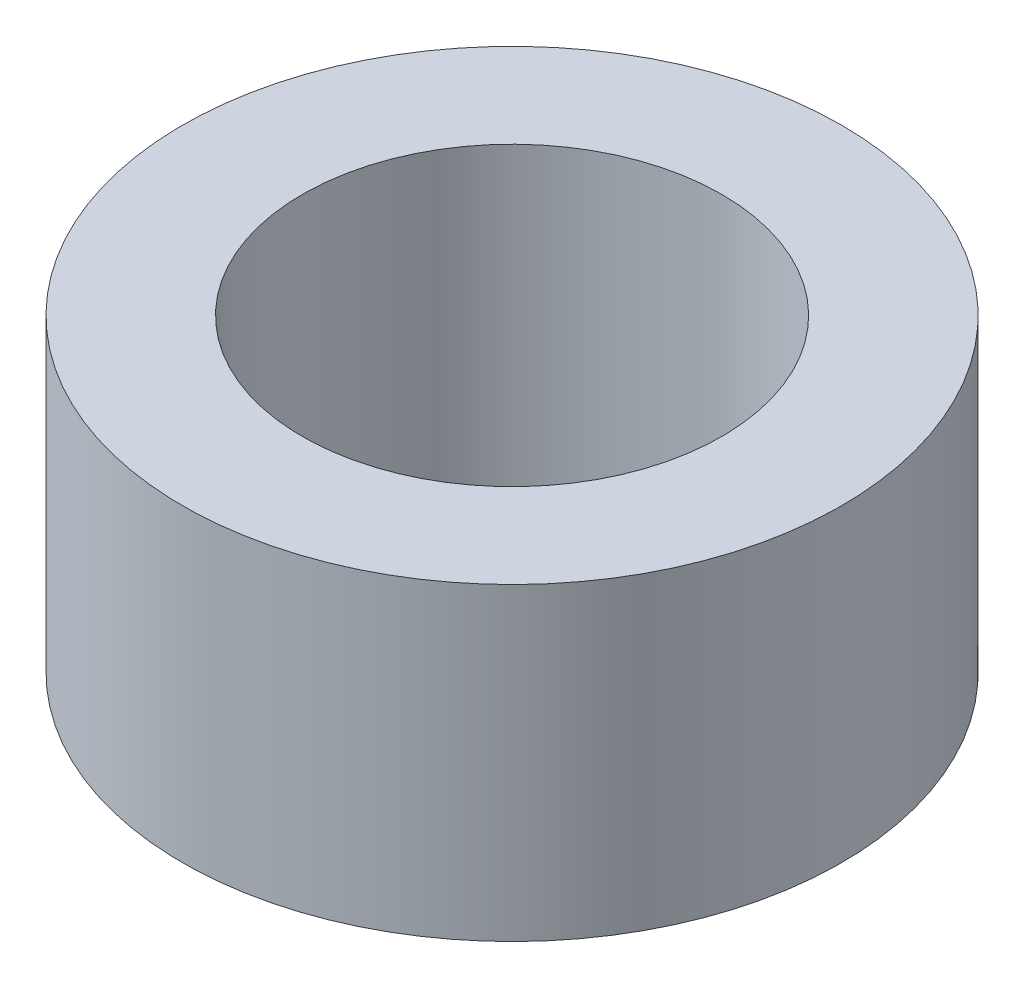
from build123d import *

# Parameters (mm, degrees)
SKETCH1_R      = 13.75
SKETCH1_R_2    = 8.75
EXTRUDE1_DEPTH = 12.9


with BuildPart() as part:
    # Sketch1 → Extrude1 (new body)
    with BuildSketch(Plane(origin=(0, 0, 0), x_dir=(1, 0, 0), z_dir=(0, 1, 0))):
        with Locations(Location((0, 0, 0), (0, 0, 90))):
            Circle(SKETCH1_R)
        with Locations(Location((0, 0, 0), (0, 0, 90))):
            Circle(SKETCH1_R_2, mode=Mode.SUBTRACT)
    extrude(amount=EXTRUDE1_DEPTH)


solid = part.part
